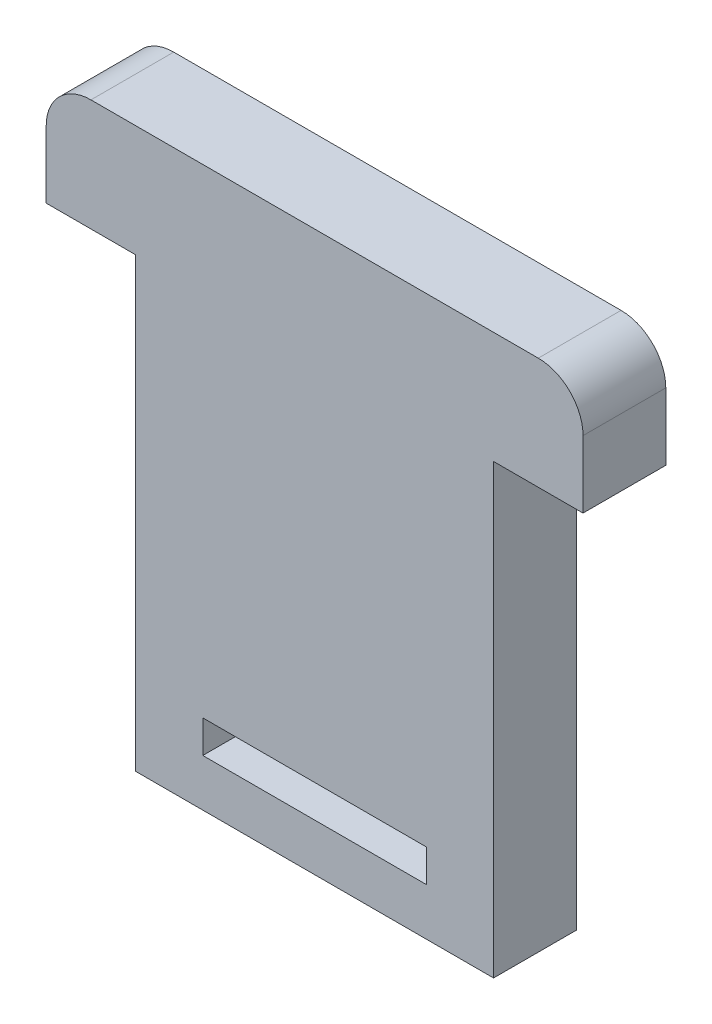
ISO-10303-21;
HEADER;
FILE_DESCRIPTION(('STEP AP214'),'2;1');
FILE_NAME('part.step','',(''),(''),'','','');
FILE_SCHEMA(('AUTOMOTIVE_DESIGN { 1 0 10303 214 1 1 1 1 }'));
ENDSEC;
DATA;
#1=APPLICATION_CONTEXT('core data for automotive mechanical design processes');
#2=APPLICATION_PROTOCOL_DEFINITION('international standard','automotive_design',2000,#1);
#3=PRODUCT_CONTEXT('',#1,'mechanical');
#4=PRODUCT('Part','Part','',(#3));
#5=PRODUCT_RELATED_PRODUCT_CATEGORY('part','',(#4));
#6=PRODUCT_DEFINITION_FORMATION('','',#4);
#7=PRODUCT_DEFINITION_CONTEXT('part definition',#1,'design');
#8=PRODUCT_DEFINITION('design','',#6,#7);
#9=PRODUCT_DEFINITION_SHAPE('','',#8);
#10=(LENGTH_UNIT() NAMED_UNIT(*) SI_UNIT(.MILLI.,.METRE.));
#11=(NAMED_UNIT(*) PLANE_ANGLE_UNIT() SI_UNIT($,.RADIAN.));
#12=(NAMED_UNIT(*) SI_UNIT($,.STERADIAN.) SOLID_ANGLE_UNIT());
#13=UNCERTAINTY_MEASURE_WITH_UNIT(LENGTH_MEASURE(1.E-05),#10,'distance_accuracy_value','');
#14=(GEOMETRIC_REPRESENTATION_CONTEXT(3) GLOBAL_UNCERTAINTY_ASSIGNED_CONTEXT((#13)) GLOBAL_UNIT_ASSIGNED_CONTEXT((#10,
#11,#12)) REPRESENTATION_CONTEXT('',''));
#15=CARTESIAN_POINT('',(0.,0.,0.));
#16=DIRECTION('',(0.,0.,1.));
#17=DIRECTION('',(1.,0.,0.));
#18=AXIS2_PLACEMENT_3D('',#15,#16,#17);
#19=CARTESIAN_POINT('',(-15.24,19.05,2.3495));
#20=DIRECTION('',(1.,0.,0.));
#21=DIRECTION('',(0.,0.,-1.));
#22=AXIS2_PLACEMENT_3D('',#19,#20,#21);
#23=PLANE('',#22);
#24=DIRECTION('',(0.,-1.,0.));
#25=VECTOR('',#24,1.);
#26=CARTESIAN_POINT('',(-15.24,19.05,2.3495));
#27=LINE('',#26,#25);
#28=CARTESIAN_POINT('',(-15.24,16.51,2.3495));
#29=VERTEX_POINT('',#28);
#30=CARTESIAN_POINT('',(-15.24,12.7,2.3495));
#31=VERTEX_POINT('',#30);
#32=EDGE_CURVE('E180',#29,#31,#27,.T.);
#33=ORIENTED_EDGE('',*,*,#32,.F.);
#34=DIRECTION('',(0.,0.,-1.));
#35=VECTOR('',#34,1.);
#36=CARTESIAN_POINT('',(-15.24,16.51,2.3495));
#37=LINE('',#36,#35);
#38=CARTESIAN_POINT('',(-15.24,16.51,-2.3495));
#39=VERTEX_POINT('',#38);
#40=EDGE_CURVE('E11',#29,#39,#37,.T.);
#41=ORIENTED_EDGE('',*,*,#40,.T.);
#42=DIRECTION('',(0.,-1.,0.));
#43=VECTOR('',#42,1.);
#44=CARTESIAN_POINT('',(-15.24,19.05,-2.3495));
#45=LINE('',#44,#43);
#46=CARTESIAN_POINT('',(-15.24,12.7,-2.3495));
#47=VERTEX_POINT('',#46);
#48=EDGE_CURVE('E176',#39,#47,#45,.T.);
#49=ORIENTED_EDGE('',*,*,#48,.T.);
#50=DIRECTION('',(0.,0.,-1.));
#51=VECTOR('',#50,1.);
#52=CARTESIAN_POINT('',(-15.24,12.7,2.3495));
#53=LINE('',#52,#51);
#54=EDGE_CURVE('E227',#31,#47,#53,.T.);
#55=ORIENTED_EDGE('',*,*,#54,.F.);
#56=EDGE_LOOP('',(#33,#41,#49,#55));
#57=FACE_BOUND('',#56,.T.);
#58=ADVANCED_FACE('F33',(#57),#23,.F.);
#59=CARTESIAN_POINT('',(-15.24,12.7,2.3495));
#60=DIRECTION('',(0.,1.,0.));
#61=DIRECTION('',(0.,0.,1.));
#62=AXIS2_PLACEMENT_3D('',#59,#60,#61);
#63=PLANE('',#62);
#64=DIRECTION('',(1.,0.,0.));
#65=VECTOR('',#64,1.);
#66=CARTESIAN_POINT('',(-15.24,12.7,-2.3495));
#67=LINE('',#66,#65);
#68=CARTESIAN_POINT('',(-10.16,12.7,-2.3495));
#69=VERTEX_POINT('',#68);
#70=EDGE_CURVE('E199',#47,#69,#67,.T.);
#71=ORIENTED_EDGE('',*,*,#70,.T.);
#72=DIRECTION('',(0.,0.,-1.));
#73=VECTOR('',#72,1.);
#74=CARTESIAN_POINT('',(-10.16,12.7,2.3495));
#75=LINE('',#74,#73);
#76=CARTESIAN_POINT('',(-10.16,12.7,2.3495));
#77=VERTEX_POINT('',#76);
#78=EDGE_CURVE('E224',#77,#69,#75,.T.);
#79=ORIENTED_EDGE('',*,*,#78,.F.);
#80=DIRECTION('',(1.,0.,0.));
#81=VECTOR('',#80,1.);
#82=CARTESIAN_POINT('',(-15.24,12.7,2.3495));
#83=LINE('',#82,#81);
#84=EDGE_CURVE('E182',#31,#77,#83,.T.);
#85=ORIENTED_EDGE('',*,*,#84,.F.);
#86=ORIENTED_EDGE('',*,*,#54,.T.);
#87=EDGE_LOOP('',(#71,#79,#85,#86));
#88=FACE_BOUND('',#87,.T.);
#89=ADVANCED_FACE('F279',(#88),#63,.F.);
#90=CARTESIAN_POINT('',(-10.16,12.7,2.3495));
#91=DIRECTION('',(1.,0.,0.));
#92=DIRECTION('',(0.,0.,-1.));
#93=AXIS2_PLACEMENT_3D('',#90,#91,#92);
#94=PLANE('',#93);
#95=DIRECTION('',(0.,-1.,0.));
#96=VECTOR('',#95,1.);
#97=CARTESIAN_POINT('',(-10.16,12.7,-2.3495));
#98=LINE('',#97,#96);
#99=CARTESIAN_POINT('',(-10.16,-12.7,-2.3495));
#100=VERTEX_POINT('',#99);
#101=EDGE_CURVE('E201',#69,#100,#98,.T.);
#102=ORIENTED_EDGE('',*,*,#101,.T.);
#103=DIRECTION('',(0.,0.,-1.));
#104=VECTOR('',#103,1.);
#105=CARTESIAN_POINT('',(-10.16,-12.7,2.3495));
#106=LINE('',#105,#104);
#107=CARTESIAN_POINT('',(-10.16,-12.7,2.3495));
#108=VERTEX_POINT('',#107);
#109=EDGE_CURVE('E221',#108,#100,#106,.T.);
#110=ORIENTED_EDGE('',*,*,#109,.F.);
#111=DIRECTION('',(0.,-1.,0.));
#112=VECTOR('',#111,1.);
#113=CARTESIAN_POINT('',(-10.16,12.7,2.3495));
#114=LINE('',#113,#112);
#115=EDGE_CURVE('E185',#77,#108,#114,.T.);
#116=ORIENTED_EDGE('',*,*,#115,.F.);
#117=ORIENTED_EDGE('',*,*,#78,.T.);
#118=EDGE_LOOP('',(#102,#110,#116,#117));
#119=FACE_BOUND('',#118,.T.);
#120=ADVANCED_FACE('F272',(#119),#94,.F.);
#121=CARTESIAN_POINT('',(-10.16,-12.7,2.3495));
#122=DIRECTION('',(0.,1.,0.));
#123=DIRECTION('',(0.,0.,1.));
#124=AXIS2_PLACEMENT_3D('',#121,#122,#123);
#125=PLANE('',#124);
#126=DIRECTION('',(1.,0.,0.));
#127=VECTOR('',#126,1.);
#128=CARTESIAN_POINT('',(-10.16,-12.7,-2.3495));
#129=LINE('',#128,#127);
#130=CARTESIAN_POINT('',(10.16,-12.7,-2.3495));
#131=VERTEX_POINT('',#130);
#132=EDGE_CURVE('E203',#100,#131,#129,.T.);
#133=ORIENTED_EDGE('',*,*,#132,.T.);
#134=DIRECTION('',(0.,0.,-1.));
#135=VECTOR('',#134,1.);
#136=CARTESIAN_POINT('',(10.16,-12.7,2.3495));
#137=LINE('',#136,#135);
#138=CARTESIAN_POINT('',(10.16,-12.7,2.3495));
#139=VERTEX_POINT('',#138);
#140=EDGE_CURVE('E218',#139,#131,#137,.T.);
#141=ORIENTED_EDGE('',*,*,#140,.F.);
#142=DIRECTION('',(1.,0.,0.));
#143=VECTOR('',#142,1.);
#144=CARTESIAN_POINT('',(-10.16,-12.7,2.3495));
#145=LINE('',#144,#143);
#146=EDGE_CURVE('E187',#108,#139,#145,.T.);
#147=ORIENTED_EDGE('',*,*,#146,.F.);
#148=ORIENTED_EDGE('',*,*,#109,.T.);
#149=EDGE_LOOP('',(#133,#141,#147,#148));
#150=FACE_BOUND('',#149,.T.);
#151=ADVANCED_FACE('F268',(#150),#125,.F.);
#152=CARTESIAN_POINT('',(10.16,-12.7,2.3495));
#153=DIRECTION('',(-1.,0.,0.));
#154=DIRECTION('',(0.,0.,1.));
#155=AXIS2_PLACEMENT_3D('',#152,#153,#154);
#156=PLANE('',#155);
#157=DIRECTION('',(0.,1.,0.));
#158=VECTOR('',#157,1.);
#159=CARTESIAN_POINT('',(10.16,-12.7,-2.3495));
#160=LINE('',#159,#158);
#161=CARTESIAN_POINT('',(10.16,12.7,-2.3495));
#162=VERTEX_POINT('',#161);
#163=EDGE_CURVE('E205',#131,#162,#160,.T.);
#164=ORIENTED_EDGE('',*,*,#163,.T.);
#165=DIRECTION('',(0.,0.,-1.));
#166=VECTOR('',#165,1.);
#167=CARTESIAN_POINT('',(10.16,12.7,2.3495));
#168=LINE('',#167,#166);
#169=CARTESIAN_POINT('',(10.16,12.7,2.3495));
#170=VERTEX_POINT('',#169);
#171=EDGE_CURVE('E215',#170,#162,#168,.T.);
#172=ORIENTED_EDGE('',*,*,#171,.F.);
#173=DIRECTION('',(0.,1.,0.));
#174=VECTOR('',#173,1.);
#175=CARTESIAN_POINT('',(10.16,-12.7,2.3495));
#176=LINE('',#175,#174);
#177=EDGE_CURVE('E189',#139,#170,#176,.T.);
#178=ORIENTED_EDGE('',*,*,#177,.F.);
#179=ORIENTED_EDGE('',*,*,#140,.T.);
#180=EDGE_LOOP('',(#164,#172,#178,#179));
#181=FACE_BOUND('',#180,.T.);
#182=ADVANCED_FACE('F263',(#181),#156,.F.);
#183=CARTESIAN_POINT('',(10.16,12.7,2.3495));
#184=DIRECTION('',(0.,1.,0.));
#185=DIRECTION('',(0.,0.,1.));
#186=AXIS2_PLACEMENT_3D('',#183,#184,#185);
#187=PLANE('',#186);
#188=DIRECTION('',(1.,0.,0.));
#189=VECTOR('',#188,1.);
#190=CARTESIAN_POINT('',(10.16,12.7,-2.3495));
#191=LINE('',#190,#189);
#192=CARTESIAN_POINT('',(15.24,12.7,-2.3495));
#193=VERTEX_POINT('',#192);
#194=EDGE_CURVE('E207',#162,#193,#191,.T.);
#195=ORIENTED_EDGE('',*,*,#194,.T.);
#196=DIRECTION('',(0.,0.,-1.));
#197=VECTOR('',#196,1.);
#198=CARTESIAN_POINT('',(15.24,12.7,2.3495));
#199=LINE('',#198,#197);
#200=CARTESIAN_POINT('',(15.24,12.7,2.3495));
#201=VERTEX_POINT('',#200);
#202=EDGE_CURVE('E197',#201,#193,#199,.T.);
#203=ORIENTED_EDGE('',*,*,#202,.F.);
#204=DIRECTION('',(1.,0.,0.));
#205=VECTOR('',#204,1.);
#206=CARTESIAN_POINT('',(10.16,12.7,2.3495));
#207=LINE('',#206,#205);
#208=EDGE_CURVE('E191',#170,#201,#207,.T.);
#209=ORIENTED_EDGE('',*,*,#208,.F.);
#210=ORIENTED_EDGE('',*,*,#171,.T.);
#211=EDGE_LOOP('',(#195,#203,#209,#210));
#212=FACE_BOUND('',#211,.T.);
#213=ADVANCED_FACE('F257',(#212),#187,.F.);
#214=CARTESIAN_POINT('',(15.24,12.7,2.3495));
#215=DIRECTION('',(-1.,0.,0.));
#216=DIRECTION('',(0.,0.,1.));
#217=AXIS2_PLACEMENT_3D('',#214,#215,#216);
#218=PLANE('',#217);
#219=DIRECTION('',(0.,1.,0.));
#220=VECTOR('',#219,1.);
#221=CARTESIAN_POINT('',(15.24,12.7,-2.3495));
#222=LINE('',#221,#220);
#223=CARTESIAN_POINT('',(15.24,16.51,-2.3495));
#224=VERTEX_POINT('',#223);
#225=EDGE_CURVE('E209',#193,#224,#222,.T.);
#226=ORIENTED_EDGE('',*,*,#225,.T.);
#227=DIRECTION('',(0.,0.,-1.));
#228=VECTOR('',#227,1.);
#229=CARTESIAN_POINT('',(15.24,16.51,2.3495));
#230=LINE('',#229,#228);
#231=CARTESIAN_POINT('',(15.24,16.51,2.3495));
#232=VERTEX_POINT('',#231);
#233=EDGE_CURVE('E56',#224,#232,#230,.F.);
#234=ORIENTED_EDGE('',*,*,#233,.T.);
#235=DIRECTION('',(0.,1.,0.));
#236=VECTOR('',#235,1.);
#237=CARTESIAN_POINT('',(15.24,12.7,2.3495));
#238=LINE('',#237,#236);
#239=EDGE_CURVE('E193',#201,#232,#238,.T.);
#240=ORIENTED_EDGE('',*,*,#239,.F.);
#241=ORIENTED_EDGE('',*,*,#202,.T.);
#242=EDGE_LOOP('',(#226,#234,#240,#241));
#243=FACE_BOUND('',#242,.T.);
#244=ADVANCED_FACE('F253',(#243),#218,.F.);
#245=CARTESIAN_POINT('',(15.24,19.05,2.3495));
#246=DIRECTION('',(0.,-1.,0.));
#247=DIRECTION('',(0.,0.,-1.));
#248=AXIS2_PLACEMENT_3D('',#245,#246,#247);
#249=PLANE('',#248);
#250=DIRECTION('',(-1.,0.,0.));
#251=VECTOR('',#250,1.);
#252=CARTESIAN_POINT('',(15.24,19.05,2.3495));
#253=LINE('',#252,#251);
#254=CARTESIAN_POINT('',(12.7,19.05,2.3495));
#255=VERTEX_POINT('',#254);
#256=CARTESIAN_POINT('',(-12.7,19.05,2.3495));
#257=VERTEX_POINT('',#256);
#258=EDGE_CURVE('E195',#255,#257,#253,.T.);
#259=ORIENTED_EDGE('',*,*,#258,.F.);
#260=DIRECTION('',(0.,0.,-1.));
#261=VECTOR('',#260,1.);
#262=CARTESIAN_POINT('',(12.7,19.05,2.3495));
#263=LINE('',#262,#261);
#264=CARTESIAN_POINT('',(12.7,19.05,-2.3495));
#265=VERTEX_POINT('',#264);
#266=EDGE_CURVE('E232',#255,#265,#263,.T.);
#267=ORIENTED_EDGE('',*,*,#266,.T.);
#268=DIRECTION('',(-1.,0.,0.));
#269=VECTOR('',#268,1.);
#270=CARTESIAN_POINT('',(15.24,19.05,-2.3495));
#271=LINE('',#270,#269);
#272=CARTESIAN_POINT('',(-12.7,19.05,-2.3495));
#273=VERTEX_POINT('',#272);
#274=EDGE_CURVE('E183',#265,#273,#271,.T.);
#275=ORIENTED_EDGE('',*,*,#274,.T.);
#276=DIRECTION('',(0.,0.,-1.));
#277=VECTOR('',#276,1.);
#278=CARTESIAN_POINT('',(-12.7,19.05,2.3495));
#279=LINE('',#278,#277);
#280=EDGE_CURVE('E230',#273,#257,#279,.F.);
#281=ORIENTED_EDGE('',*,*,#280,.T.);
#282=EDGE_LOOP('',(#259,#267,#275,#281));
#283=FACE_BOUND('',#282,.T.);
#284=ADVANCED_FACE('F245',(#283),#249,.F.);
#285=CARTESIAN_POINT('',(0.,0.,2.3495));
#286=DIRECTION('',(0.,0.,1.));
#287=DIRECTION('',(1.,0.,0.));
#288=AXIS2_PLACEMENT_3D('',#285,#286,#287);
#289=PLANE('',#288);
#290=DIRECTION('',(0.,1.,0.));
#291=VECTOR('',#290,1.);
#292=CARTESIAN_POINT('',(-6.35,-10.013,2.3495));
#293=LINE('',#292,#291);
#294=CARTESIAN_POINT('',(-6.35,-10.013,2.3495));
#295=VERTEX_POINT('',#294);
#296=CARTESIAN_POINT('',(-6.35,-8.16299999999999,2.3495));
#297=VERTEX_POINT('',#296);
#298=EDGE_CURVE('E141',#295,#297,#293,.T.);
#299=ORIENTED_EDGE('',*,*,#298,.T.);
#300=DIRECTION('',(1.,0.,0.));
#301=VECTOR('',#300,1.);
#302=CARTESIAN_POINT('',(-6.35,-8.16299999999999,2.3495));
#303=LINE('',#302,#301);
#304=CARTESIAN_POINT('',(6.35,-8.16299999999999,2.3495));
#305=VERTEX_POINT('',#304);
#306=EDGE_CURVE('E153',#297,#305,#303,.T.);
#307=ORIENTED_EDGE('',*,*,#306,.T.);
#308=DIRECTION('',(0.,-1.,0.));
#309=VECTOR('',#308,1.);
#310=CARTESIAN_POINT('',(6.35,-8.16299999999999,2.3495));
#311=LINE('',#310,#309);
#312=CARTESIAN_POINT('',(6.35,-10.013,2.3495));
#313=VERTEX_POINT('',#312);
#314=EDGE_CURVE('E157',#305,#313,#311,.T.);
#315=ORIENTED_EDGE('',*,*,#314,.T.);
#316=DIRECTION('',(-1.,0.,0.));
#317=VECTOR('',#316,1.);
#318=CARTESIAN_POINT('',(6.35,-10.013,2.3495));
#319=LINE('',#318,#317);
#320=EDGE_CURVE('E149',#313,#295,#319,.T.);
#321=ORIENTED_EDGE('',*,*,#320,.T.);
#322=EDGE_LOOP('',(#299,#307,#315,#321));
#323=FACE_BOUND('',#322,.T.);
#324=ORIENTED_EDGE('',*,*,#239,.T.);
#325=CARTESIAN_POINT('',(12.7,16.51,2.3495));
#326=DIRECTION('',(0.,0.,1.));
#327=DIRECTION('',(1.,0.,0.));
#328=AXIS2_PLACEMENT_3D('',#325,#326,#327);
#329=CIRCLE('',#328,2.54);
#330=EDGE_CURVE('E41',#232,#255,#329,.T.);
#331=ORIENTED_EDGE('',*,*,#330,.T.);
#332=ORIENTED_EDGE('',*,*,#258,.T.);
#333=CARTESIAN_POINT('',(-12.7,16.51,2.3495));
#334=DIRECTION('',(0.,0.,1.));
#335=DIRECTION('',(1.,0.,0.));
#336=AXIS2_PLACEMENT_3D('',#333,#334,#335);
#337=CIRCLE('',#336,2.54);
#338=EDGE_CURVE('E48',#257,#29,#337,.T.);
#339=ORIENTED_EDGE('',*,*,#338,.T.);
#340=ORIENTED_EDGE('',*,*,#32,.T.);
#341=ORIENTED_EDGE('',*,*,#84,.T.);
#342=ORIENTED_EDGE('',*,*,#115,.T.);
#343=ORIENTED_EDGE('',*,*,#146,.T.);
#344=ORIENTED_EDGE('',*,*,#177,.T.);
#345=ORIENTED_EDGE('',*,*,#208,.T.);
#346=EDGE_LOOP('',(#324,#331,#332,#339,#340,#341,#342,#343,#344,#345));
#347=FACE_BOUND('',#346,.T.);
#348=ADVANCED_FACE('F159',(#323,#347),#289,.T.);
#349=CARTESIAN_POINT('',(0.,0.,-2.3495));
#350=DIRECTION('',(0.,0.,1.));
#351=DIRECTION('',(1.,0.,0.));
#352=AXIS2_PLACEMENT_3D('',#349,#350,#351);
#353=PLANE('',#352);
#354=DIRECTION('',(1.,0.,0.));
#355=VECTOR('',#354,1.);
#356=CARTESIAN_POINT('',(-6.35,-8.16299999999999,-2.3495));
#357=LINE('',#356,#355);
#358=CARTESIAN_POINT('',(-6.35,-8.16299999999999,-2.3495));
#359=VERTEX_POINT('',#358);
#360=CARTESIAN_POINT('',(6.35,-8.16299999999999,-2.3495));
#361=VERTEX_POINT('',#360);
#362=EDGE_CURVE('E170',#359,#361,#357,.T.);
#363=ORIENTED_EDGE('',*,*,#362,.F.);
#364=DIRECTION('',(0.,1.,0.));
#365=VECTOR('',#364,1.);
#366=CARTESIAN_POINT('',(-6.35,-10.013,-2.3495));
#367=LINE('',#366,#365);
#368=CARTESIAN_POINT('',(-6.35,-10.013,-2.3495));
#369=VERTEX_POINT('',#368);
#370=EDGE_CURVE('E144',#369,#359,#367,.T.);
#371=ORIENTED_EDGE('',*,*,#370,.F.);
#372=DIRECTION('',(-1.,0.,0.));
#373=VECTOR('',#372,1.);
#374=CARTESIAN_POINT('',(6.35,-10.013,-2.3495));
#375=LINE('',#374,#373);
#376=CARTESIAN_POINT('',(6.35,-10.013,-2.3495));
#377=VERTEX_POINT('',#376);
#378=EDGE_CURVE('E161',#377,#369,#375,.T.);
#379=ORIENTED_EDGE('',*,*,#378,.F.);
#380=DIRECTION('',(0.,-1.,0.));
#381=VECTOR('',#380,1.);
#382=CARTESIAN_POINT('',(6.35,-8.16299999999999,-2.3495));
#383=LINE('',#382,#381);
#384=EDGE_CURVE('E164',#361,#377,#383,.T.);
#385=ORIENTED_EDGE('',*,*,#384,.F.);
#386=EDGE_LOOP('',(#363,#371,#379,#385));
#387=FACE_BOUND('',#386,.T.);
#388=ORIENTED_EDGE('',*,*,#274,.F.);
#389=CARTESIAN_POINT('',(12.7,16.51,-2.3495));
#390=DIRECTION('',(0.,0.,1.));
#391=DIRECTION('',(1.,0.,0.));
#392=AXIS2_PLACEMENT_3D('',#389,#390,#391);
#393=CIRCLE('',#392,2.54);
#394=EDGE_CURVE('E237',#265,#224,#393,.F.);
#395=ORIENTED_EDGE('',*,*,#394,.T.);
#396=ORIENTED_EDGE('',*,*,#225,.F.);
#397=ORIENTED_EDGE('',*,*,#194,.F.);
#398=ORIENTED_EDGE('',*,*,#163,.F.);
#399=ORIENTED_EDGE('',*,*,#132,.F.);
#400=ORIENTED_EDGE('',*,*,#101,.F.);
#401=ORIENTED_EDGE('',*,*,#70,.F.);
#402=ORIENTED_EDGE('',*,*,#48,.F.);
#403=CARTESIAN_POINT('',(-12.7,16.51,-2.3495));
#404=DIRECTION('',(0.,0.,1.));
#405=DIRECTION('',(1.,0.,0.));
#406=AXIS2_PLACEMENT_3D('',#403,#404,#405);
#407=CIRCLE('',#406,2.54);
#408=EDGE_CURVE('E235',#39,#273,#407,.F.);
#409=ORIENTED_EDGE('',*,*,#408,.T.);
#410=EDGE_LOOP('',(#388,#395,#396,#397,#398,#399,#400,#401,#402,#409));
#411=FACE_BOUND('',#410,.T.);
#412=ADVANCED_FACE('F251',(#387,#411),#353,.F.);
#413=CARTESIAN_POINT('',(-6.35,-10.013,2.3495));
#414=DIRECTION('',(-1.,0.,0.));
#415=DIRECTION('',(0.,0.,1.));
#416=AXIS2_PLACEMENT_3D('',#413,#414,#415);
#417=PLANE('',#416);
#418=ORIENTED_EDGE('',*,*,#370,.T.);
#419=DIRECTION('',(0.,0.,-1.));
#420=VECTOR('',#419,1.);
#421=CARTESIAN_POINT('',(-6.35,-8.16299999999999,2.3495));
#422=LINE('',#421,#420);
#423=EDGE_CURVE('E137',#297,#359,#422,.T.);
#424=ORIENTED_EDGE('',*,*,#423,.F.);
#425=ORIENTED_EDGE('',*,*,#298,.F.);
#426=DIRECTION('',(0.,0.,-1.));
#427=VECTOR('',#426,1.);
#428=CARTESIAN_POINT('',(-6.35,-10.013,2.3495));
#429=LINE('',#428,#427);
#430=EDGE_CURVE('E174',#295,#369,#429,.T.);
#431=ORIENTED_EDGE('',*,*,#430,.T.);
#432=EDGE_LOOP('',(#418,#424,#425,#431));
#433=FACE_BOUND('',#432,.T.);
#434=ADVANCED_FACE('F139',(#433),#417,.F.);
#435=CARTESIAN_POINT('',(6.35,-10.013,2.3495));
#436=DIRECTION('',(0.,-1.,0.));
#437=DIRECTION('',(0.,0.,-1.));
#438=AXIS2_PLACEMENT_3D('',#435,#436,#437);
#439=PLANE('',#438);
#440=ORIENTED_EDGE('',*,*,#378,.T.);
#441=ORIENTED_EDGE('',*,*,#430,.F.);
#442=ORIENTED_EDGE('',*,*,#320,.F.);
#443=DIRECTION('',(0.,0.,-1.));
#444=VECTOR('',#443,1.);
#445=CARTESIAN_POINT('',(6.35,-10.013,2.3495));
#446=LINE('',#445,#444);
#447=EDGE_CURVE('E177',#313,#377,#446,.T.);
#448=ORIENTED_EDGE('',*,*,#447,.T.);
#449=EDGE_LOOP('',(#440,#441,#442,#448));
#450=FACE_BOUND('',#449,.T.);
#451=ADVANCED_FACE('F313',(#450),#439,.F.);
#452=CARTESIAN_POINT('',(6.35,-8.16299999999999,2.3495));
#453=DIRECTION('',(1.,0.,0.));
#454=DIRECTION('',(0.,0.,-1.));
#455=AXIS2_PLACEMENT_3D('',#452,#453,#454);
#456=PLANE('',#455);
#457=ORIENTED_EDGE('',*,*,#384,.T.);
#458=ORIENTED_EDGE('',*,*,#447,.F.);
#459=ORIENTED_EDGE('',*,*,#314,.F.);
#460=DIRECTION('',(0.,0.,-1.));
#461=VECTOR('',#460,1.);
#462=CARTESIAN_POINT('',(6.35,-8.16299999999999,2.3495));
#463=LINE('',#462,#461);
#464=EDGE_CURVE('E148',#305,#361,#463,.T.);
#465=ORIENTED_EDGE('',*,*,#464,.T.);
#466=EDGE_LOOP('',(#457,#458,#459,#465));
#467=FACE_BOUND('',#466,.T.);
#468=ADVANCED_FACE('F316',(#467),#456,.F.);
#469=CARTESIAN_POINT('',(-6.35,-8.16299999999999,2.3495));
#470=DIRECTION('',(0.,1.,0.));
#471=DIRECTION('',(0.,0.,1.));
#472=AXIS2_PLACEMENT_3D('',#469,#470,#471);
#473=PLANE('',#472);
#474=ORIENTED_EDGE('',*,*,#362,.T.);
#475=ORIENTED_EDGE('',*,*,#464,.F.);
#476=ORIENTED_EDGE('',*,*,#306,.F.);
#477=ORIENTED_EDGE('',*,*,#423,.T.);
#478=EDGE_LOOP('',(#474,#475,#476,#477));
#479=FACE_BOUND('',#478,.T.);
#480=ADVANCED_FACE('F154',(#479),#473,.F.);
#481=CARTESIAN_POINT('',(12.7,16.51,2.3495));
#482=DIRECTION('',(0.,0.,-1.));
#483=DIRECTION('',(-1.,0.,0.));
#484=AXIS2_PLACEMENT_3D('',#481,#482,#483);
#485=CYLINDRICAL_SURFACE('',#484,2.54);
#486=ORIENTED_EDGE('',*,*,#330,.F.);
#487=ORIENTED_EDGE('',*,*,#233,.F.);
#488=ORIENTED_EDGE('',*,*,#394,.F.);
#489=ORIENTED_EDGE('',*,*,#266,.F.);
#490=EDGE_LOOP('',(#486,#487,#488,#489));
#491=FACE_BOUND('',#490,.T.);
#492=ADVANCED_FACE('F248',(#491),#485,.T.);
#493=CARTESIAN_POINT('',(-12.7,16.51,2.3495));
#494=DIRECTION('',(0.,0.,-1.));
#495=DIRECTION('',(-1.,0.,0.));
#496=AXIS2_PLACEMENT_3D('',#493,#494,#495);
#497=CYLINDRICAL_SURFACE('',#496,2.54);
#498=ORIENTED_EDGE('',*,*,#338,.F.);
#499=ORIENTED_EDGE('',*,*,#280,.F.);
#500=ORIENTED_EDGE('',*,*,#408,.F.);
#501=ORIENTED_EDGE('',*,*,#40,.F.);
#502=EDGE_LOOP('',(#498,#499,#500,#501));
#503=FACE_BOUND('',#502,.T.);
#504=ADVANCED_FACE('F35',(#503),#497,.T.);
#505=CLOSED_SHELL('',(#58,#89,#120,#151,#182,#213,#244,#284,#348,#412,#434,#451,#468,#480,#492,#504));
#506=MANIFOLD_SOLID_BREP('B2',#505);
#507=ADVANCED_BREP_SHAPE_REPRESENTATION('',(#18,#506),#14);
#508=SHAPE_DEFINITION_REPRESENTATION(#9,#507);
ENDSEC;
END-ISO-10303-21;
